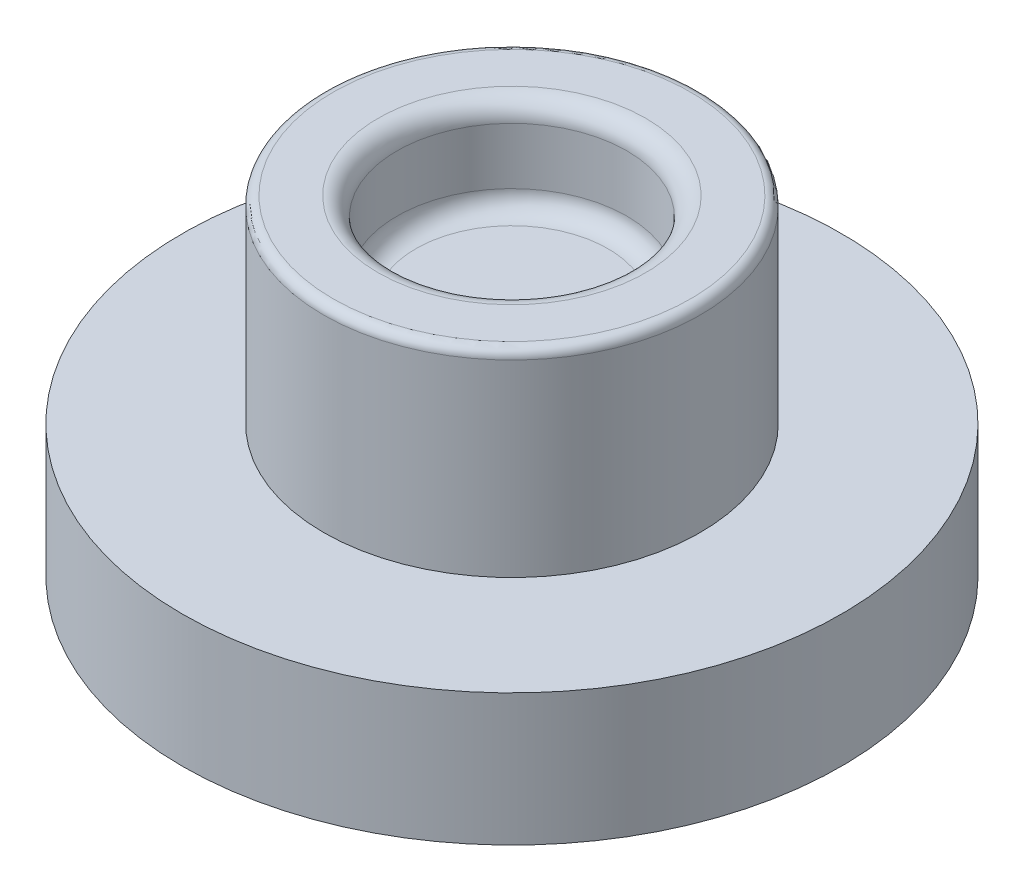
from build123d import *


with BuildPart() as part:
    # Sketch1 → Revolve1 (revolve)
    with BuildSketch(Plane(origin=(0, 0, 0), x_dir=(-1, 0, 0), z_dir=(0, 0, -1)), mode=Mode.PRIVATE) as revolve1_sk:
        with BuildLine():
            Line((-3.5, -1.4), (0, -1.4))
            Line((0, -1.4), (0, 1.1))
            Line((0, 1.1), (-1.02119739, 1.1))
            ThreePointArc((-1.02119739, 1.1), (-1.162618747, 1.158578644), (-1.22119739, 1.3))
            Line((-1.22119739, 1.3), (-1.22119739, 1.9))
            ThreePointArc((-1.22119739, 1.9), (-1.279776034, 2.041421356), (-1.42119739, 2.1))
            Line((-1.42119739, 2.1), (-1.9, 2.1))
            ThreePointArc((-1.9, 2.1), (-1.970710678, 2.070710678), (-2, 2))
            Line((-2, 2), (-2, 0))
            Line((-2, 0), (-3.5, 0))
            Line((-3.5, 0), (-3.5, -1.4))
        make_face()
    revolve(revolve1_sk.sketch.rotate(Axis((0, -1.4, 0), (0, 1, 0)), 270), axis=Axis((0, -1.4, 0), (0, 1, 0)))


solid = part.part
